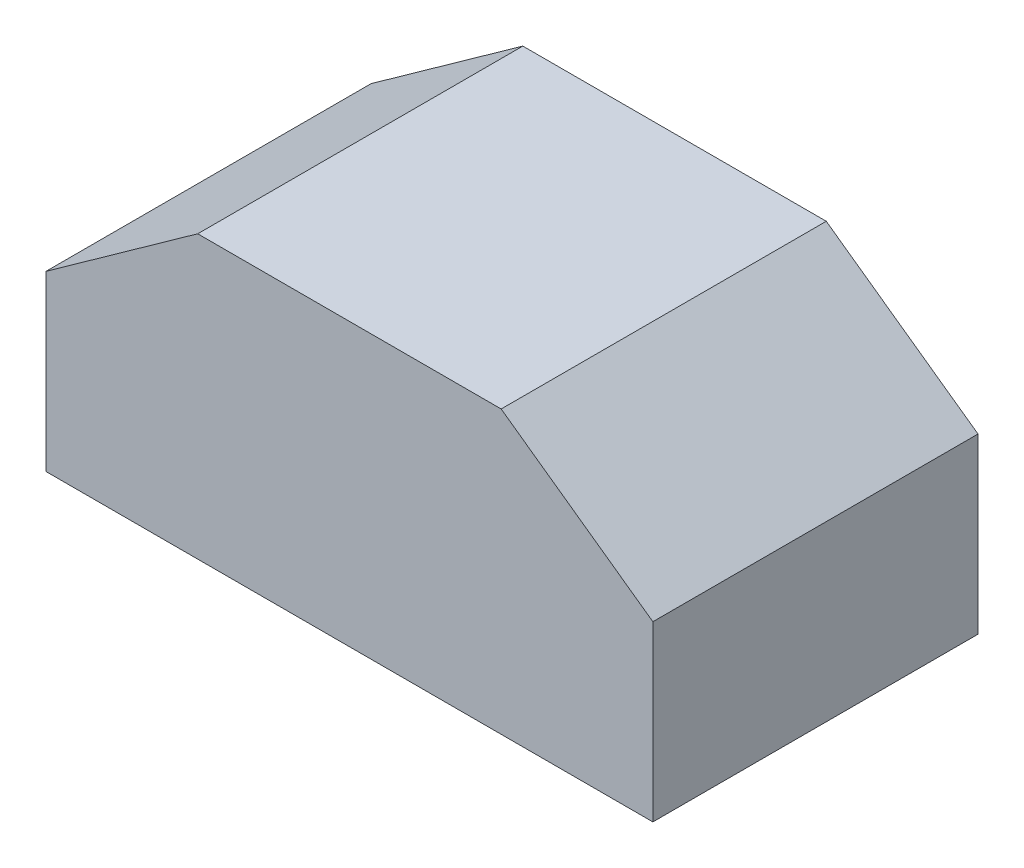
from build123d import *

# Parameters (mm, degrees)
BOSS_EXTRU_1_DEPTH = 37.5


with BuildPart() as part:
    # Esquisse1 → Boss.-Extru.1 (new, symmetric)
    with BuildSketch(Plane.XY):
        Polygon((-70, 0), (70, 0), (70, 40), (35, 65), (-35, 65), (-70, 40), align=None)
    extrude(amount=BOSS_EXTRU_1_DEPTH, both=True)


solid = part.part
